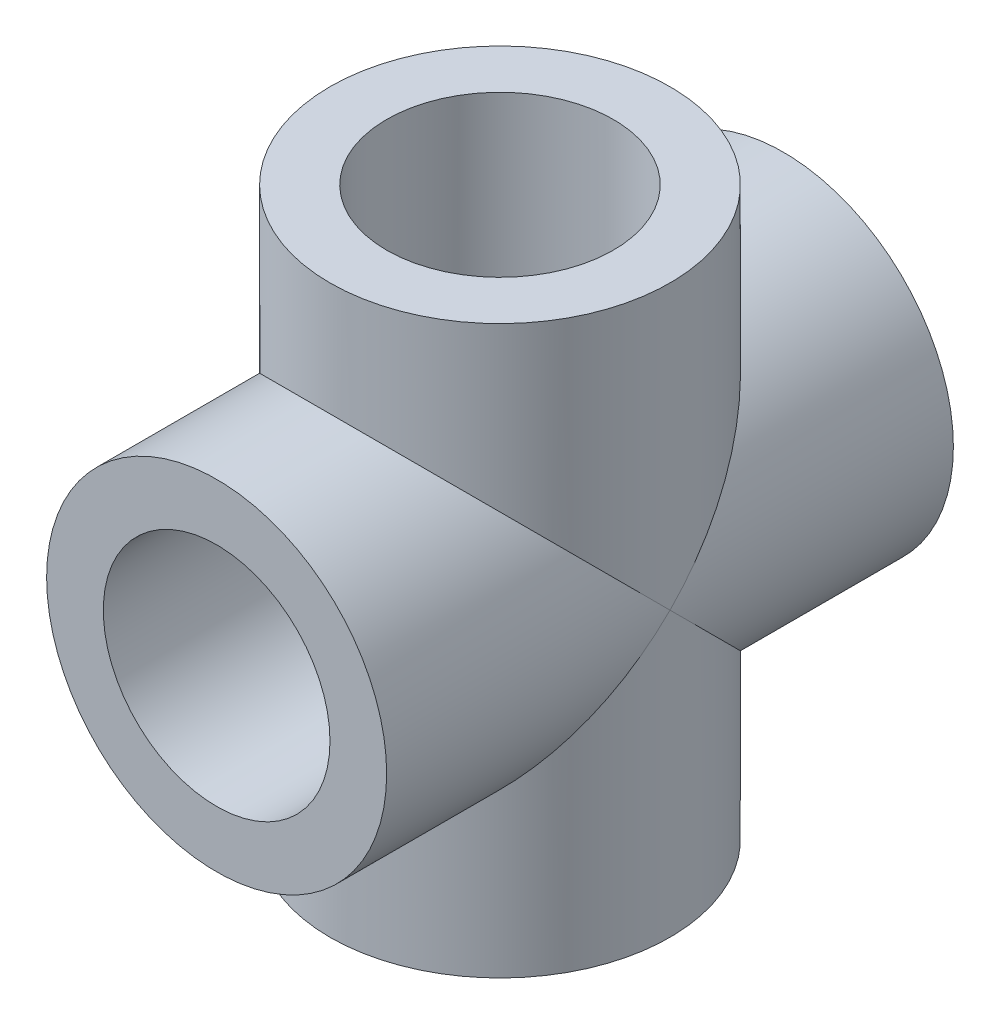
ISO-10303-21;
HEADER;
FILE_DESCRIPTION(('STEP AP214'),'2;1');
FILE_NAME('part.step','',(''),(''),'','','');
FILE_SCHEMA(('AUTOMOTIVE_DESIGN { 1 0 10303 214 1 1 1 1 }'));
ENDSEC;
DATA;
#1=APPLICATION_CONTEXT('core data for automotive mechanical design processes');
#2=APPLICATION_PROTOCOL_DEFINITION('international standard','automotive_design',2000,#1);
#3=PRODUCT_CONTEXT('',#1,'mechanical');
#4=PRODUCT('Part','Part','',(#3));
#5=PRODUCT_RELATED_PRODUCT_CATEGORY('part','',(#4));
#6=PRODUCT_DEFINITION_FORMATION('','',#4);
#7=PRODUCT_DEFINITION_CONTEXT('part definition',#1,'design');
#8=PRODUCT_DEFINITION('design','',#6,#7);
#9=PRODUCT_DEFINITION_SHAPE('','',#8);
#10=(LENGTH_UNIT() NAMED_UNIT(*) SI_UNIT(.MILLI.,.METRE.));
#11=(NAMED_UNIT(*) PLANE_ANGLE_UNIT() SI_UNIT($,.RADIAN.));
#12=(NAMED_UNIT(*) SI_UNIT($,.STERADIAN.) SOLID_ANGLE_UNIT());
#13=UNCERTAINTY_MEASURE_WITH_UNIT(LENGTH_MEASURE(1.E-05),#10,'distance_accuracy_value','');
#14=(GEOMETRIC_REPRESENTATION_CONTEXT(3) GLOBAL_UNCERTAINTY_ASSIGNED_CONTEXT((#13)) GLOBAL_UNIT_ASSIGNED_CONTEXT((#10,
#11,#12)) REPRESENTATION_CONTEXT('',''));
#15=CARTESIAN_POINT('',(0.,0.,0.));
#16=DIRECTION('',(0.,0.,1.));
#17=DIRECTION('',(1.,0.,0.));
#18=AXIS2_PLACEMENT_3D('',#15,#16,#17);
#19=CARTESIAN_POINT('',(0.,10.,-10.));
#20=DIRECTION('',(0.,0.,1.));
#21=DIRECTION('',(1.,0.,0.));
#22=AXIS2_PLACEMENT_3D('',#19,#20,#21);
#23=CYLINDRICAL_SURFACE('',#22,4.);
#24=CARTESIAN_POINT('',(0.,10.,10.));
#25=DIRECTION('',(0.,0.,1.));
#26=DIRECTION('',(1.,0.,0.));
#27=AXIS2_PLACEMENT_3D('',#24,#25,#26);
#28=CIRCLE('',#27,4.);
#29=CARTESIAN_POINT('',(4.,10.,10.));
#30=VERTEX_POINT('',#29);
#31=EDGE_CURVE('E95',#30,#30,#28,.T.);
#32=ORIENTED_EDGE('',*,*,#31,.T.);
#33=EDGE_LOOP('',(#32));
#34=FACE_BOUND('',#33,.T.);
#35=CARTESIAN_POINT('',(0.,10.,0.));
#36=DIRECTION('',(0.,-0.707106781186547,0.707106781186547));
#37=DIRECTION('',(0.,0.707106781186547,0.707106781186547));
#38=AXIS2_PLACEMENT_3D('',#35,#36,#37);
#39=ELLIPSE('',#38,5.65685424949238,4.);
#40=CARTESIAN_POINT('',(-4.,10.,0.));
#41=VERTEX_POINT('',#40);
#42=CARTESIAN_POINT('',(4.,10.,0.));
#43=VERTEX_POINT('',#42);
#44=EDGE_CURVE('E44',#41,#43,#39,.F.);
#45=ORIENTED_EDGE('',*,*,#44,.T.);
#46=CARTESIAN_POINT('',(0.,10.,0.));
#47=DIRECTION('',(0.,0.707106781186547,0.707106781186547));
#48=DIRECTION('',(0.,-0.707106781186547,0.707106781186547));
#49=AXIS2_PLACEMENT_3D('',#46,#47,#48);
#50=ELLIPSE('',#49,5.65685424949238,4.);
#51=EDGE_CURVE('E11',#43,#41,#50,.F.);
#52=ORIENTED_EDGE('',*,*,#51,.T.);
#53=EDGE_LOOP('',(#45,#52));
#54=FACE_BOUND('',#53,.T.);
#55=ADVANCED_FACE('F31',(#34,#54),#23,.F.);
#56=CARTESIAN_POINT('',(0.,20.,0.));
#57=DIRECTION('',(0.,-1.,0.));
#58=DIRECTION('',(0.,0.,-1.));
#59=AXIS2_PLACEMENT_3D('',#56,#57,#58);
#60=CYLINDRICAL_SURFACE('',#59,6.);
#61=CARTESIAN_POINT('',(0.,20.,0.));
#62=DIRECTION('',(0.,1.,0.));
#63=DIRECTION('',(0.,0.,1.));
#64=AXIS2_PLACEMENT_3D('',#61,#62,#63);
#65=CIRCLE('',#64,6.);
#66=CARTESIAN_POINT('',(0.,20.,6.));
#67=VERTEX_POINT('',#66);
#68=EDGE_CURVE('E82',#67,#67,#65,.T.);
#69=ORIENTED_EDGE('',*,*,#68,.F.);
#70=EDGE_LOOP('',(#69));
#71=FACE_BOUND('',#70,.T.);
#72=CARTESIAN_POINT('',(0.,10.,0.));
#73=DIRECTION('',(0.,-0.707106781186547,-0.707106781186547));
#74=DIRECTION('',(0.,-0.707106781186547,0.707106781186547));
#75=AXIS2_PLACEMENT_3D('',#72,#73,#74);
#76=ELLIPSE('',#75,8.48528137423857,6.);
#77=CARTESIAN_POINT('',(-6.,10.,0.));
#78=VERTEX_POINT('',#77);
#79=CARTESIAN_POINT('',(6.,10.,0.));
#80=VERTEX_POINT('',#79);
#81=EDGE_CURVE('E76',#78,#80,#76,.T.);
#82=ORIENTED_EDGE('',*,*,#81,.F.);
#83=CARTESIAN_POINT('',(0.,10.,0.));
#84=DIRECTION('',(0.,-0.707106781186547,0.707106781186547));
#85=DIRECTION('',(0.,-0.707106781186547,-0.707106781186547));
#86=AXIS2_PLACEMENT_3D('',#83,#84,#85);
#87=ELLIPSE('',#86,8.48528137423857,6.);
#88=EDGE_CURVE('E78',#80,#78,#87,.T.);
#89=ORIENTED_EDGE('',*,*,#88,.F.);
#90=EDGE_LOOP('',(#82,#89));
#91=FACE_BOUND('',#90,.T.);
#92=ADVANCED_FACE('F112',(#71,#91),#60,.T.);
#93=CARTESIAN_POINT('',(0.,20.,0.));
#94=DIRECTION('',(0.,1.,0.));
#95=DIRECTION('',(0.,0.,1.));
#96=AXIS2_PLACEMENT_3D('',#93,#94,#95);
#97=PLANE('',#96);
#98=CARTESIAN_POINT('',(0.,20.,0.));
#99=DIRECTION('',(0.,1.,0.));
#100=DIRECTION('',(0.,0.,1.));
#101=AXIS2_PLACEMENT_3D('',#98,#99,#100);
#102=CIRCLE('',#101,4.);
#103=CARTESIAN_POINT('',(0.,20.,4.));
#104=VERTEX_POINT('',#103);
#105=EDGE_CURVE('E103',#104,#104,#102,.T.);
#106=ORIENTED_EDGE('',*,*,#105,.F.);
#107=EDGE_LOOP('',(#106));
#108=FACE_BOUND('',#107,.T.);
#109=ORIENTED_EDGE('',*,*,#68,.T.);
#110=EDGE_LOOP('',(#109));
#111=FACE_BOUND('',#110,.T.);
#112=ADVANCED_FACE('F108',(#108,#111),#97,.T.);
#113=CARTESIAN_POINT('',(0.,10.,-10.));
#114=DIRECTION('',(0.,0.,1.));
#115=DIRECTION('',(1.,0.,0.));
#116=AXIS2_PLACEMENT_3D('',#113,#114,#115);
#117=PLANE('',#116);
#118=CARTESIAN_POINT('',(0.,10.,-10.));
#119=DIRECTION('',(0.,0.,1.));
#120=DIRECTION('',(1.,0.,0.));
#121=AXIS2_PLACEMENT_3D('',#118,#119,#120);
#122=CIRCLE('',#121,4.);
#123=CARTESIAN_POINT('',(4.,10.,-10.));
#124=VERTEX_POINT('',#123);
#125=EDGE_CURVE('E92',#124,#124,#122,.T.);
#126=ORIENTED_EDGE('',*,*,#125,.T.);
#127=EDGE_LOOP('',(#126));
#128=FACE_BOUND('',#127,.T.);
#129=CARTESIAN_POINT('',(0.,10.,-10.));
#130=DIRECTION('',(0.,0.,1.));
#131=DIRECTION('',(1.,0.,0.));
#132=AXIS2_PLACEMENT_3D('',#129,#130,#131);
#133=CIRCLE('',#132,6.);
#134=CARTESIAN_POINT('',(6.,10.,-10.));
#135=VERTEX_POINT('',#134);
#136=EDGE_CURVE('E89',#135,#135,#133,.T.);
#137=ORIENTED_EDGE('',*,*,#136,.F.);
#138=EDGE_LOOP('',(#137));
#139=FACE_BOUND('',#138,.T.);
#140=ADVANCED_FACE('F111',(#128,#139),#117,.F.);
#141=CARTESIAN_POINT('',(0.,10.,10.));
#142=DIRECTION('',(0.,0.,-1.));
#143=DIRECTION('',(-1.,0.,0.));
#144=AXIS2_PLACEMENT_3D('',#141,#142,#143);
#145=CYLINDRICAL_SURFACE('',#144,6.);
#146=ORIENTED_EDGE('',*,*,#136,.T.);
#147=EDGE_LOOP('',(#146));
#148=FACE_BOUND('',#147,.T.);
#149=CARTESIAN_POINT('',(0.,10.,0.));
#150=DIRECTION('',(0.,-0.707106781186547,0.707106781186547));
#151=DIRECTION('',(0.,-0.707106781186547,-0.707106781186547));
#152=AXIS2_PLACEMENT_3D('',#149,#150,#151);
#153=ELLIPSE('',#152,8.48528137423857,6.);
#154=EDGE_CURVE('E51',#80,#78,#153,.F.);
#155=ORIENTED_EDGE('',*,*,#154,.T.);
#156=ORIENTED_EDGE('',*,*,#81,.T.);
#157=EDGE_LOOP('',(#155,#156));
#158=FACE_BOUND('',#157,.T.);
#159=ADVANCED_FACE('F132',(#148,#158),#145,.T.);
#160=CARTESIAN_POINT('',(0.,0.,0.));
#161=DIRECTION('',(0.,1.,0.));
#162=DIRECTION('',(0.,0.,1.));
#163=AXIS2_PLACEMENT_3D('',#160,#161,#162);
#164=PLANE('',#163);
#165=CARTESIAN_POINT('',(0.,0.,0.));
#166=DIRECTION('',(0.,1.,0.));
#167=DIRECTION('',(0.,0.,1.));
#168=AXIS2_PLACEMENT_3D('',#165,#166,#167);
#169=CIRCLE('',#168,4.);
#170=CARTESIAN_POINT('',(0.,0.,4.));
#171=VERTEX_POINT('',#170);
#172=EDGE_CURVE('E98',#171,#171,#169,.T.);
#173=ORIENTED_EDGE('',*,*,#172,.T.);
#174=EDGE_LOOP('',(#173));
#175=FACE_BOUND('',#174,.T.);
#176=CARTESIAN_POINT('',(0.,0.,0.));
#177=DIRECTION('',(0.,1.,0.));
#178=DIRECTION('',(0.,0.,1.));
#179=AXIS2_PLACEMENT_3D('',#176,#177,#178);
#180=CIRCLE('',#179,6.);
#181=CARTESIAN_POINT('',(0.,0.,6.));
#182=VERTEX_POINT('',#181);
#183=EDGE_CURVE('E83',#182,#182,#180,.T.);
#184=ORIENTED_EDGE('',*,*,#183,.F.);
#185=EDGE_LOOP('',(#184));
#186=FACE_BOUND('',#185,.T.);
#187=ADVANCED_FACE('F123',(#175,#186),#164,.F.);
#188=ORIENTED_EDGE('',*,*,#183,.T.);
#189=EDGE_LOOP('',(#188));
#190=FACE_BOUND('',#189,.T.);
#191=CARTESIAN_POINT('',(0.,10.,0.));
#192=DIRECTION('',(0.,-0.707106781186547,-0.707106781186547));
#193=DIRECTION('',(0.,-0.707106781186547,0.707106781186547));
#194=AXIS2_PLACEMENT_3D('',#191,#192,#193);
#195=ELLIPSE('',#194,8.48528137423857,6.);
#196=EDGE_CURVE('E69',#78,#80,#195,.F.);
#197=ORIENTED_EDGE('',*,*,#196,.F.);
#198=ORIENTED_EDGE('',*,*,#154,.F.);
#199=EDGE_LOOP('',(#197,#198));
#200=FACE_BOUND('',#199,.T.);
#201=ADVANCED_FACE('F33',(#190,#200),#60,.T.);
#202=CARTESIAN_POINT('',(0.,10.,10.));
#203=DIRECTION('',(0.,0.,1.));
#204=DIRECTION('',(1.,0.,0.));
#205=AXIS2_PLACEMENT_3D('',#202,#203,#204);
#206=CIRCLE('',#205,6.);
#207=CARTESIAN_POINT('',(6.,10.,10.));
#208=VERTEX_POINT('',#207);
#209=EDGE_CURVE('E86',#208,#208,#206,.T.);
#210=ORIENTED_EDGE('',*,*,#209,.F.);
#211=EDGE_LOOP('',(#210));
#212=FACE_BOUND('',#211,.T.);
#213=ORIENTED_EDGE('',*,*,#88,.T.);
#214=ORIENTED_EDGE('',*,*,#196,.T.);
#215=EDGE_LOOP('',(#213,#214));
#216=FACE_BOUND('',#215,.T.);
#217=ADVANCED_FACE('F120',(#212,#216),#145,.T.);
#218=CARTESIAN_POINT('',(0.,10.,10.));
#219=DIRECTION('',(0.,0.,1.));
#220=DIRECTION('',(1.,0.,0.));
#221=AXIS2_PLACEMENT_3D('',#218,#219,#220);
#222=PLANE('',#221);
#223=ORIENTED_EDGE('',*,*,#31,.F.);
#224=EDGE_LOOP('',(#223));
#225=FACE_BOUND('',#224,.T.);
#226=ORIENTED_EDGE('',*,*,#209,.T.);
#227=EDGE_LOOP('',(#226));
#228=FACE_BOUND('',#227,.T.);
#229=ADVANCED_FACE('F129',(#225,#228),#222,.T.);
#230=CARTESIAN_POINT('',(0.,10.,0.));
#231=DIRECTION('',(0.,-0.707106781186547,0.707106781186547));
#232=DIRECTION('',(0.,0.707106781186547,0.707106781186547));
#233=AXIS2_PLACEMENT_3D('',#230,#231,#232);
#234=ELLIPSE('',#233,5.65685424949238,4.);
#235=EDGE_CURVE('E61',#41,#43,#234,.T.);
#236=ORIENTED_EDGE('',*,*,#235,.T.);
#237=CARTESIAN_POINT('',(0.,10.,0.));
#238=DIRECTION('',(0.,0.707106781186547,0.707106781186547));
#239=DIRECTION('',(0.,-0.707106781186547,0.707106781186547));
#240=AXIS2_PLACEMENT_3D('',#237,#238,#239);
#241=ELLIPSE('',#240,5.65685424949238,4.);
#242=EDGE_CURVE('E39',#43,#41,#241,.T.);
#243=ORIENTED_EDGE('',*,*,#242,.T.);
#244=EDGE_LOOP('',(#236,#243));
#245=FACE_BOUND('',#244,.T.);
#246=ORIENTED_EDGE('',*,*,#125,.F.);
#247=EDGE_LOOP('',(#246));
#248=FACE_BOUND('',#247,.T.);
#249=ADVANCED_FACE('F71',(#245,#248),#23,.F.);
#250=CARTESIAN_POINT('',(0.,-20.,0.));
#251=DIRECTION('',(0.,1.,0.));
#252=DIRECTION('',(0.,0.,1.));
#253=AXIS2_PLACEMENT_3D('',#250,#251,#252);
#254=CYLINDRICAL_SURFACE('',#253,4.);
#255=ORIENTED_EDGE('',*,*,#105,.T.);
#256=EDGE_LOOP('',(#255));
#257=FACE_BOUND('',#256,.T.);
#258=ORIENTED_EDGE('',*,*,#44,.F.);
#259=ORIENTED_EDGE('',*,*,#242,.F.);
#260=EDGE_LOOP('',(#258,#259));
#261=FACE_BOUND('',#260,.T.);
#262=ADVANCED_FACE('F68',(#257,#261),#254,.F.);
#263=ORIENTED_EDGE('',*,*,#235,.F.);
#264=ORIENTED_EDGE('',*,*,#51,.F.);
#265=EDGE_LOOP('',(#263,#264));
#266=FACE_BOUND('',#265,.T.);
#267=ORIENTED_EDGE('',*,*,#172,.F.);
#268=EDGE_LOOP('',(#267));
#269=FACE_BOUND('',#268,.T.);
#270=ADVANCED_FACE('F62',(#266,#269),#254,.F.);
#271=CLOSED_SHELL('',(#55,#92,#112,#140,#159,#187,#201,#217,#229,#249,#262,#270));
#272=MANIFOLD_SOLID_BREP('B2',#271);
#273=ADVANCED_BREP_SHAPE_REPRESENTATION('',(#18,#272),#14);
#274=SHAPE_DEFINITION_REPRESENTATION(#9,#273);
ENDSEC;
END-ISO-10303-21;
